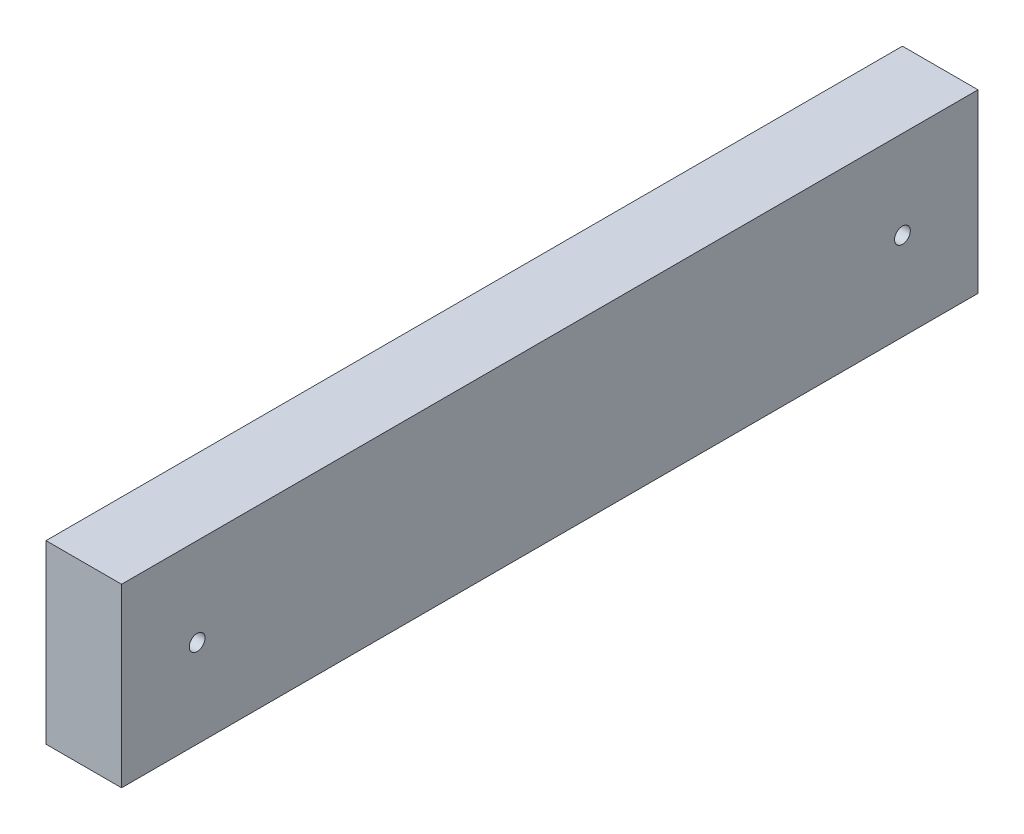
from build123d import *

# Parameters (mm, degrees)
SKETCH1_W                      = 38.1
SKETCH1_H                      = 88.9
BOSS_EXTRUDE1_DEPTH            = 431.8
F_5_16_0_3125_DIAMETER_HOLE1_D = 7.9375


with BuildPart() as part:
    # Sketch1 → Boss-Extrude1 (new body)
    with BuildSketch(Plane.XY):
        Rectangle(SKETCH1_W, SKETCH1_H)
    extrude(amount=BOSS_EXTRUDE1_DEPTH)

    # 5_16 _0.3125_ Diameter Hole1 (through all)
    with Locations(Plane(origin=(19.05, 0, 0), x_dir=(0, 0, -1), z_dir=(1, 0, 0))):
        with Locations((-393.7, 0), (-38.1, 0)):
            Hole(F_5_16_0_3125_DIAMETER_HOLE1_D / 2)


solid = part.part
